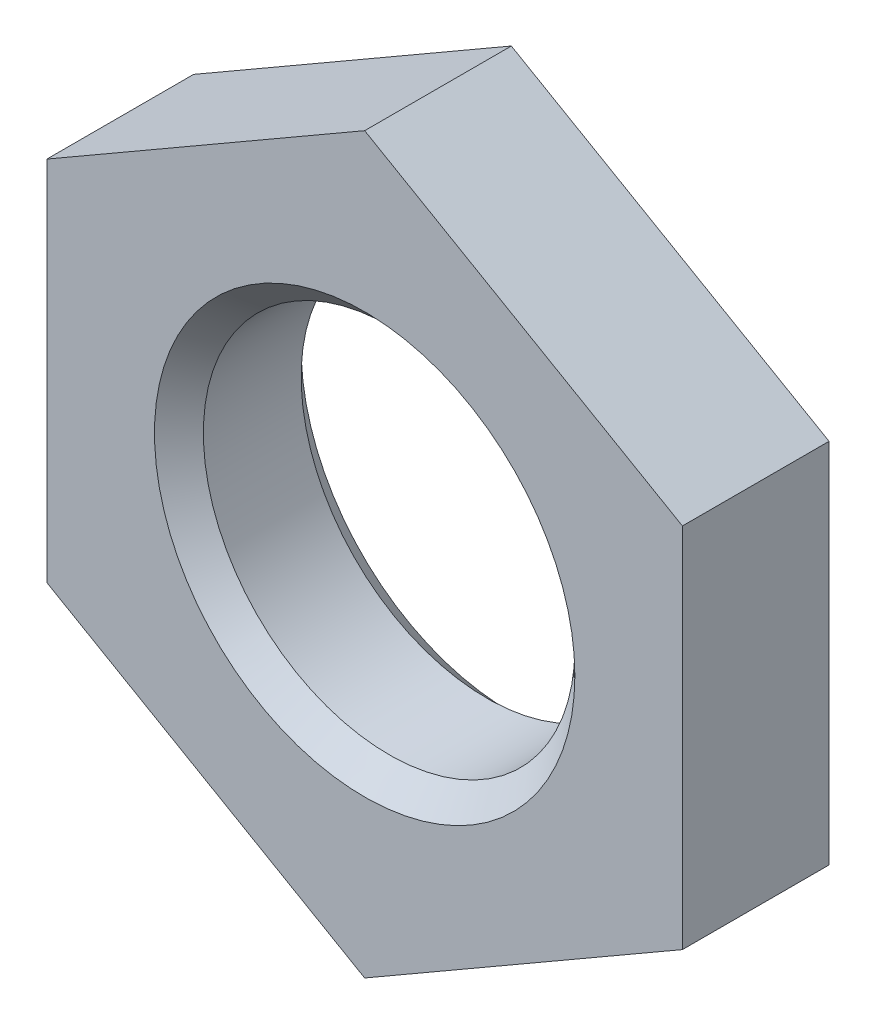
from build123d import *

# Parameters (mm, degrees)
EXTRUSION1_DEPTH     = 3
D_GAGEMENT_M71_D     = 7.6
D_GAGEMENT_M71_DEPTH = 7
D_GAGEMENT_M71_TIP   = 2.283270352
CHANFREIN1_SIZE      = 0.5


with BuildPart() as part:
    # Esquisse1 → Extrusion1 (new body)
    with BuildSketch(Plane.XY):
        Polygon((0, 7.505553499), (-6.5, 3.75277675), (-6.5, -3.75277675), (0, -7.505553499), (6.5, -3.75277675), (6.5, 3.75277675), align=None)
    extrude(amount=EXTRUSION1_DEPTH)

    # D_gagement M71
    with Locations(Plane(origin=(0, -0.000553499, 3), x_dir=(1, 0, 0), z_dir=(0, 0, 1))):
        with Locations((0, 0)):
            Hole(D_GAGEMENT_M71_D / 2, depth=D_GAGEMENT_M71_DEPTH)
            with Locations((0, 0, -(D_GAGEMENT_M71_DEPTH + D_GAGEMENT_M71_TIP / 2))):  # 118° drill point
                Cone(0, D_GAGEMENT_M71_D / 2, D_GAGEMENT_M71_TIP, mode=Mode.SUBTRACT)

    # Chanfrein1
    chanfrein1_edges = [part.edges().sort_by_distance(p)[0] for p in [
        (3.8, -0.000553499, 0),
        (3.8, -0.000553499, 3),
    ]]
    chamfer(chanfrein1_edges, length=CHANFREIN1_SIZE)


solid = part.part
